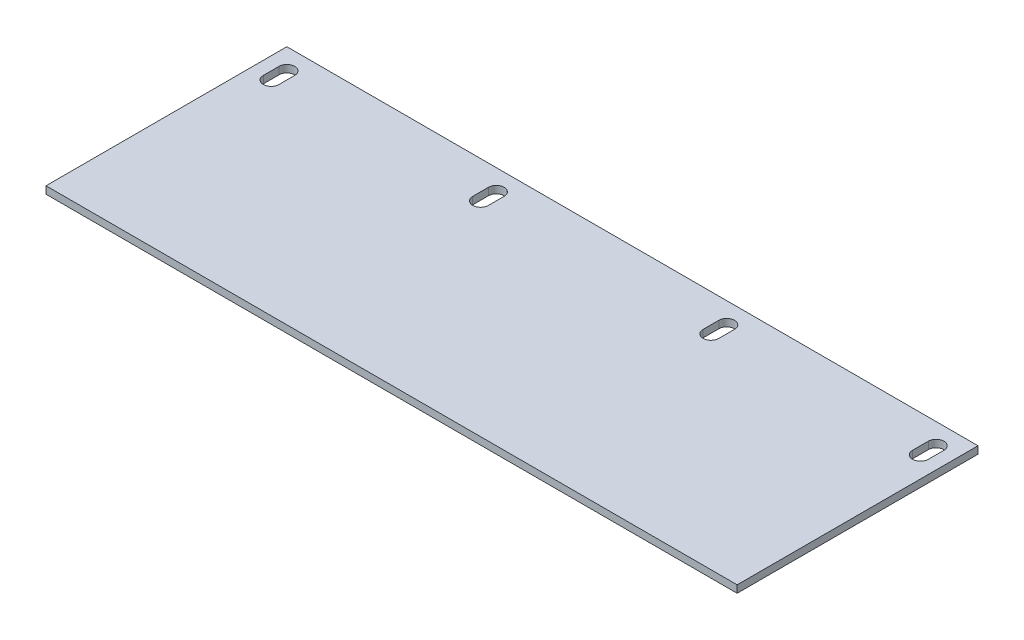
from build123d import *

# Parameters (mm, degrees)
SKETCH1_W           = 1676.4
SKETCH1_H           = 584.2
BOSS_EXTRUDE1_DEPTH = 17.8562
CUT_EXTRUDE4_DEPTH  = 888.817826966


with BuildPart() as part:
    # Sketch1 → Boss-Extrude1 (new body)
    with BuildSketch(Plane(origin=(0, 0, 0), x_dir=(1, 0, 0), z_dir=(0, 1, 0))):
        Rectangle(SKETCH1_W, SKETCH1_H)
    extrude(amount=BOSS_EXTRUDE1_DEPTH)

    # Sketch5 → Cut-Extrude4 (cut, through all)
    with BuildSketch(Plane(origin=(0, 17.8562, 0), x_dir=(1, 0, 0), z_dir=(0, 1, 0))):
        with BuildLine():
            Line((-768.35, 241.3), (-768.35, 203.2))
            ThreePointArc((-768.35, 203.2), (-787.4, 184.15), (-806.45, 203.2))
            Line((-806.45, 203.2), (-806.45, 241.3))
            ThreePointArc((-806.45, 241.3), (-787.4, 260.35), (-768.35, 241.3))
        make_face()
        with BuildLine():
            Line((-298.45, 241.3), (-298.45, 203.2))
            ThreePointArc((-298.45, 203.2), (-279.4, 184.15), (-260.35, 203.2))
            Line((-260.35, 203.2), (-260.35, 241.3))
            ThreePointArc((-260.35, 241.3), (-279.4, 260.35), (-298.45, 241.3))
        make_face()
        with BuildLine():
            Line((260.35, 241.3), (260.35, 203.2))
            ThreePointArc((260.35, 203.2), (279.4, 184.15), (298.45, 203.2))
            Line((298.45, 203.2), (298.45, 241.3))
            ThreePointArc((298.45, 241.3), (279.4, 260.35), (260.35, 241.3))
        make_face()
        with BuildLine():
            Line((768.35, 241.3), (768.35, 203.2))
            ThreePointArc((768.35, 203.2), (787.4, 184.15), (806.45, 203.2))
            Line((806.45, 203.2), (806.45, 241.3))
            ThreePointArc((806.45, 241.3), (787.4, 260.35), (768.35, 241.3))
        make_face()
    extrude(amount=-CUT_EXTRUDE4_DEPTH, mode=Mode.SUBTRACT)


solid = part.part
